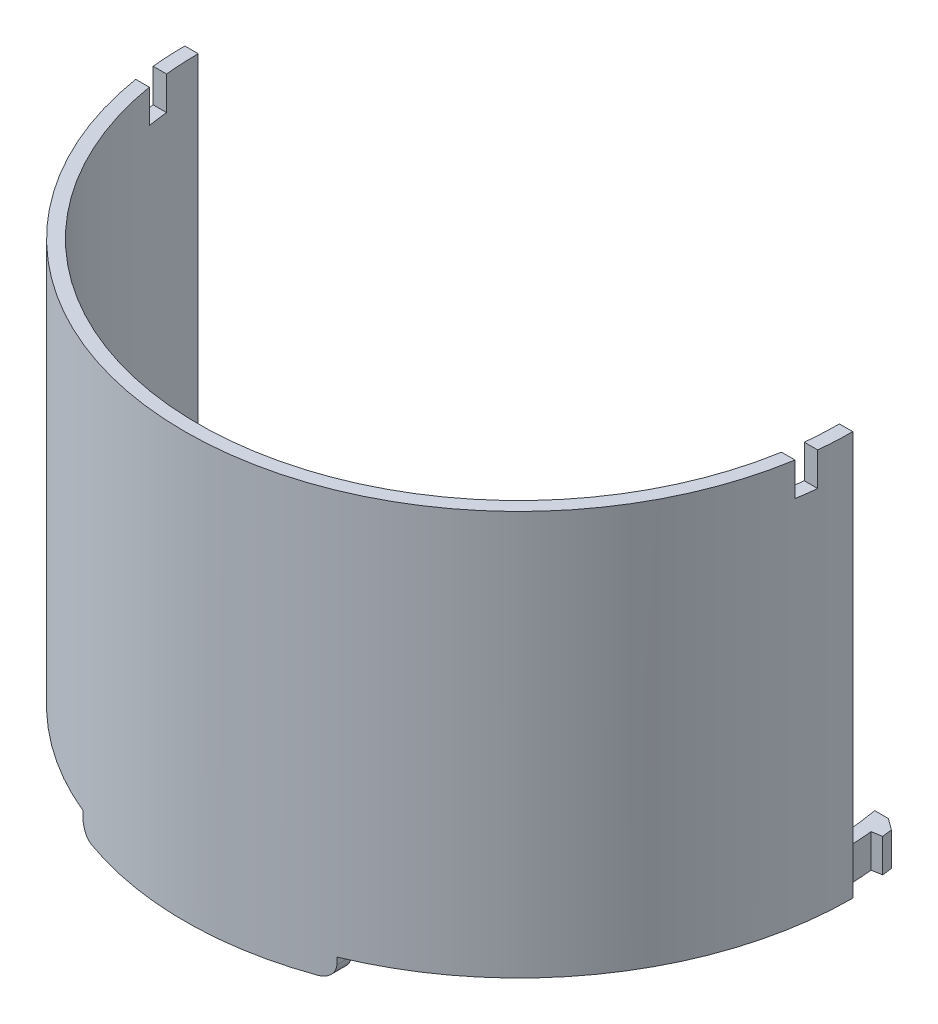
ISO-10303-21;
HEADER;
FILE_DESCRIPTION(('STEP AP214'),'2;1');
FILE_NAME('part.step','',(''),(''),'','','');
FILE_SCHEMA(('AUTOMOTIVE_DESIGN { 1 0 10303 214 1 1 1 1 }'));
ENDSEC;
DATA;
#1=APPLICATION_CONTEXT('core data for automotive mechanical design processes');
#2=APPLICATION_PROTOCOL_DEFINITION('international standard','automotive_design',2000,#1);
#3=PRODUCT_CONTEXT('',#1,'mechanical');
#4=PRODUCT('Part','Part','',(#3));
#5=PRODUCT_RELATED_PRODUCT_CATEGORY('part','',(#4));
#6=PRODUCT_DEFINITION_FORMATION('','',#4);
#7=PRODUCT_DEFINITION_CONTEXT('part definition',#1,'design');
#8=PRODUCT_DEFINITION('design','',#6,#7);
#9=PRODUCT_DEFINITION_SHAPE('','',#8);
#10=(LENGTH_UNIT() NAMED_UNIT(*) SI_UNIT(.MILLI.,.METRE.));
#11=(NAMED_UNIT(*) PLANE_ANGLE_UNIT() SI_UNIT($,.RADIAN.));
#12=(NAMED_UNIT(*) SI_UNIT($,.STERADIAN.) SOLID_ANGLE_UNIT());
#13=UNCERTAINTY_MEASURE_WITH_UNIT(LENGTH_MEASURE(1.E-05),#10,'distance_accuracy_value','');
#14=(GEOMETRIC_REPRESENTATION_CONTEXT(3) GLOBAL_UNCERTAINTY_ASSIGNED_CONTEXT((#13)) GLOBAL_UNIT_ASSIGNED_CONTEXT((#10,
#11,#12)) REPRESENTATION_CONTEXT('',''));
#15=CARTESIAN_POINT('',(0.,0.,0.));
#16=DIRECTION('',(0.,0.,1.));
#17=DIRECTION('',(1.,0.,0.));
#18=AXIS2_PLACEMENT_3D('',#15,#16,#17);
#19=CARTESIAN_POINT('',(0.,0.,0.));
#20=DIRECTION('',(0.,1.,0.));
#21=DIRECTION('',(0.,0.,1.));
#22=AXIS2_PLACEMENT_3D('',#19,#20,#21);
#23=PLANE('',#22);
#24=DIRECTION('',(0.,0.,-1.));
#25=VECTOR('',#24,1.);
#26=CARTESIAN_POINT('',(-19.,0.,44.0794736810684));
#27=LINE('',#26,#25);
#28=CARTESIAN_POINT('',(-19.,0.,46.2493243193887));
#29=VERTEX_POINT('',#28);
#30=CARTESIAN_POINT('',(-19.,0.,44.0794736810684));
#31=VERTEX_POINT('',#30);
#32=EDGE_CURVE('E275',#29,#31,#27,.T.);
#33=ORIENTED_EDGE('',*,*,#32,.F.);
#34=CARTESIAN_POINT('',(0.,0.,0.));
#35=DIRECTION('',(0.,1.,0.));
#36=DIRECTION('',(0.,0.,1.));
#37=AXIS2_PLACEMENT_3D('',#34,#35,#36);
#38=CIRCLE('',#37,50.);
#39=CARTESIAN_POINT('',(-50.,0.,0.));
#40=VERTEX_POINT('',#39);
#41=EDGE_CURVE('E269',#40,#29,#38,.T.);
#42=ORIENTED_EDGE('',*,*,#41,.F.);
#43=DIRECTION('',(-1.,0.,0.));
#44=VECTOR('',#43,1.);
#45=CARTESIAN_POINT('',(-50.,0.,0.));
#46=LINE('',#45,#44);
#47=CARTESIAN_POINT('',(-48.,0.,0.));
#48=VERTEX_POINT('',#47);
#49=EDGE_CURVE('E545',#48,#40,#46,.T.);
#50=ORIENTED_EDGE('',*,*,#49,.F.);
#51=CARTESIAN_POINT('',(0.,0.,0.));
#52=DIRECTION('',(0.,-1.,0.));
#53=DIRECTION('',(0.,0.,-1.));
#54=AXIS2_PLACEMENT_3D('',#51,#52,#53);
#55=CIRCLE('',#54,48.);
#56=CARTESIAN_POINT('',(-47.7388730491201,0.,-5.00000000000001));
#57=VERTEX_POINT('',#56);
#58=EDGE_CURVE('E356',#48,#57,#55,.T.);
#59=ORIENTED_EDGE('',*,*,#58,.T.);
#60=DIRECTION('',(-0.984809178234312,0.,-0.173640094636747));
#61=VECTOR('',#60,1.);
#62=CARTESIAN_POINT('',(-49.2196201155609,0.,-5.26108312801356));
#63=LINE('',#62,#61);
#64=CARTESIAN_POINT('',(-49.2196201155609,0.,-5.26108312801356));
#65=VERTEX_POINT('',#64);
#66=EDGE_CURVE('E934',#57,#65,#63,.T.);
#67=ORIENTED_EDGE('',*,*,#66,.T.);
#68=DIRECTION('',(0.121338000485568,0.,-0.992611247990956));
#69=VECTOR('',#68,1.);
#70=CARTESIAN_POINT('',(-49.0376131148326,0.,-6.75));
#71=LINE('',#70,#69);
#72=CARTESIAN_POINT('',(-49.0376131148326,0.,-6.75));
#73=VERTEX_POINT('',#72);
#74=EDGE_CURVE('E936',#65,#73,#71,.T.);
#75=ORIENTED_EDGE('',*,*,#74,.T.);
#76=DIRECTION('',(0.807135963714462,0.,-0.590365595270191));
#77=VECTOR('',#76,1.);
#78=CARTESIAN_POINT('',(-47.328638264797,0.,-8.));
#79=LINE('',#78,#77);
#80=CARTESIAN_POINT('',(-47.328638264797,0.,-8.));
#81=VERTEX_POINT('',#80);
#82=EDGE_CURVE('E398',#73,#81,#79,.T.);
#83=ORIENTED_EDGE('',*,*,#82,.T.);
#84=DIRECTION('',(1.,0.,0.));
#85=VECTOR('',#84,1.);
#86=CARTESIAN_POINT('',(-45.2990066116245,0.,-8.));
#87=LINE('',#86,#85);
#88=CARTESIAN_POINT('',(-45.2990066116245,0.,-8.));
#89=VERTEX_POINT('',#88);
#90=EDGE_CURVE('E396',#81,#89,#87,.T.);
#91=ORIENTED_EDGE('',*,*,#90,.T.);
#92=CARTESIAN_POINT('',(0.,0.,0.));
#93=DIRECTION('',(0.,1.,0.));
#94=DIRECTION('',(0.,0.,-1.));
#95=AXIS2_PLACEMENT_3D('',#92,#93,#94);
#96=CIRCLE('',#95,46.);
#97=CARTESIAN_POINT('',(-45.91006834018,0.,2.875));
#98=VERTEX_POINT('',#97);
#99=EDGE_CURVE('E380',#89,#98,#96,.T.);
#100=ORIENTED_EDGE('',*,*,#99,.T.);
#101=CARTESIAN_POINT('',(-45.7417046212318,0.,4.86790081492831));
#102=DIRECTION('',(0.,1.,0.));
#103=DIRECTION('',(0.,0.,1.));
#104=AXIS2_PLACEMENT_3D('',#101,#102,#103);
#105=CIRCLE('',#104,2.);
#106=CARTESIAN_POINT('',(-47.7304743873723,0.,5.07954867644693));
#107=VERTEX_POINT('',#106);
#108=EDGE_CURVE('E40',#98,#107,#105,.T.);
#109=ORIENTED_EDGE('',*,*,#108,.T.);
#110=CARTESIAN_POINT('',(0.,0.,0.));
#111=DIRECTION('',(0.,-1.,0.));
#112=DIRECTION('',(0.,0.,1.));
#113=AXIS2_PLACEMENT_3D('',#110,#111,#112);
#114=CIRCLE('',#113,48.);
#115=EDGE_CURVE('E283',#31,#107,#114,.T.);
#116=ORIENTED_EDGE('',*,*,#115,.F.);
#117=EDGE_LOOP('',(#33,#42,#50,#59,#67,#75,#83,#91,#100,#109,#116));
#118=FACE_BOUND('',#117,.T.);
#119=ADVANCED_FACE('F32',(#118),#23,.F.);
#120=DIRECTION('',(0.,0.,1.));
#121=VECTOR('',#120,1.);
#122=CARTESIAN_POINT('',(19.,0.,44.0794736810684));
#123=LINE('',#122,#121);
#124=CARTESIAN_POINT('',(19.,0.,44.0794736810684));
#125=VERTEX_POINT('',#124);
#126=CARTESIAN_POINT('',(19.,0.,46.2493243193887));
#127=VERTEX_POINT('',#126);
#128=EDGE_CURVE('E265',#125,#127,#123,.T.);
#129=ORIENTED_EDGE('',*,*,#128,.F.);
#130=CARTESIAN_POINT('',(47.7304743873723,0.,5.07954867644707));
#131=VERTEX_POINT('',#130);
#132=EDGE_CURVE('E306',#131,#125,#114,.T.);
#133=ORIENTED_EDGE('',*,*,#132,.F.);
#134=CARTESIAN_POINT('',(45.7417046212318,0.,4.86790081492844));
#135=DIRECTION('',(0.,1.,0.));
#136=DIRECTION('',(0.,0.,1.));
#137=AXIS2_PLACEMENT_3D('',#134,#135,#136);
#138=CIRCLE('',#137,2.);
#139=CARTESIAN_POINT('',(45.91006834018,0.,2.875));
#140=VERTEX_POINT('',#139);
#141=EDGE_CURVE('E365',#131,#140,#138,.T.);
#142=ORIENTED_EDGE('',*,*,#141,.T.);
#143=CARTESIAN_POINT('',(0.,0.,0.));
#144=DIRECTION('',(0.,1.,0.));
#145=DIRECTION('',(0.,0.,1.));
#146=AXIS2_PLACEMENT_3D('',#143,#144,#145);
#147=CIRCLE('',#146,46.);
#148=CARTESIAN_POINT('',(45.2990066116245,0.,-8.));
#149=VERTEX_POINT('',#148);
#150=EDGE_CURVE('E437',#140,#149,#147,.T.);
#151=ORIENTED_EDGE('',*,*,#150,.T.);
#152=DIRECTION('',(1.,0.,0.));
#153=VECTOR('',#152,1.);
#154=CARTESIAN_POINT('',(45.2990066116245,0.,-8.));
#155=LINE('',#154,#153);
#156=CARTESIAN_POINT('',(47.328638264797,0.,-8.));
#157=VERTEX_POINT('',#156);
#158=EDGE_CURVE('E440',#149,#157,#155,.T.);
#159=ORIENTED_EDGE('',*,*,#158,.T.);
#160=DIRECTION('',(0.807135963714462,0.,0.590365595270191));
#161=VECTOR('',#160,1.);
#162=CARTESIAN_POINT('',(47.328638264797,0.,-8.));
#163=LINE('',#162,#161);
#164=CARTESIAN_POINT('',(49.0376131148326,0.,-6.75));
#165=VERTEX_POINT('',#164);
#166=EDGE_CURVE('E443',#157,#165,#163,.T.);
#167=ORIENTED_EDGE('',*,*,#166,.T.);
#168=DIRECTION('',(0.121338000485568,0.,0.992611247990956));
#169=VECTOR('',#168,1.);
#170=CARTESIAN_POINT('',(49.0376131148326,0.,-6.75));
#171=LINE('',#170,#169);
#172=CARTESIAN_POINT('',(49.2196201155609,0.,-5.26108312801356));
#173=VERTEX_POINT('',#172);
#174=EDGE_CURVE('E446',#165,#173,#171,.T.);
#175=ORIENTED_EDGE('',*,*,#174,.T.);
#176=DIRECTION('',(-0.984809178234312,0.,0.173640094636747));
#177=VECTOR('',#176,1.);
#178=CARTESIAN_POINT('',(49.2196201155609,0.,-5.26108312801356));
#179=LINE('',#178,#177);
#180=CARTESIAN_POINT('',(47.7388730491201,0.,-5.));
#181=VERTEX_POINT('',#180);
#182=EDGE_CURVE('E449',#173,#181,#179,.T.);
#183=ORIENTED_EDGE('',*,*,#182,.T.);
#184=CARTESIAN_POINT('',(0.,0.,0.));
#185=DIRECTION('',(0.,-1.,0.));
#186=DIRECTION('',(0.,0.,1.));
#187=AXIS2_PLACEMENT_3D('',#184,#185,#186);
#188=CIRCLE('',#187,48.);
#189=CARTESIAN_POINT('',(48.,0.,0.));
#190=VERTEX_POINT('',#189);
#191=EDGE_CURVE('E417',#181,#190,#188,.T.);
#192=ORIENTED_EDGE('',*,*,#191,.T.);
#193=DIRECTION('',(-1.,0.,0.));
#194=VECTOR('',#193,1.);
#195=CARTESIAN_POINT('',(48.,0.,0.));
#196=LINE('',#195,#194);
#197=CARTESIAN_POINT('',(50.,0.,0.));
#198=VERTEX_POINT('',#197);
#199=EDGE_CURVE('E267',#198,#190,#196,.T.);
#200=ORIENTED_EDGE('',*,*,#199,.F.);
#201=EDGE_CURVE('E252',#127,#198,#38,.T.);
#202=ORIENTED_EDGE('',*,*,#201,.F.);
#203=EDGE_LOOP('',(#129,#133,#142,#151,#159,#167,#175,#183,#192,#200,#202));
#204=FACE_BOUND('',#203,.T.);
#205=ADVANCED_FACE('F263',(#204),#23,.F.);
#206=CARTESIAN_POINT('',(0.,60.5,0.));
#207=DIRECTION('',(0.,1.,0.));
#208=DIRECTION('',(0.,0.,1.));
#209=AXIS2_PLACEMENT_3D('',#206,#207,#208);
#210=PLANE('',#209);
#211=DIRECTION('',(-1.,0.,0.));
#212=VECTOR('',#211,1.);
#213=CARTESIAN_POINT('',(49.749371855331,60.5,5.00000000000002));
#214=LINE('',#213,#212);
#215=CARTESIAN_POINT('',(49.749371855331,60.5,5.00000000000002));
#216=VERTEX_POINT('',#215);
#217=CARTESIAN_POINT('',(47.7388730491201,60.5,5.00000000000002));
#218=VERTEX_POINT('',#217);
#219=EDGE_CURVE('E466',#216,#218,#214,.T.);
#220=ORIENTED_EDGE('',*,*,#219,.F.);
#221=CARTESIAN_POINT('',(0.,60.5,0.));
#222=DIRECTION('',(0.,1.,0.));
#223=DIRECTION('',(0.,0.,1.));
#224=AXIS2_PLACEMENT_3D('',#221,#222,#223);
#225=CIRCLE('',#224,50.);
#226=CARTESIAN_POINT('',(50.,60.5,0.));
#227=VERTEX_POINT('',#226);
#228=EDGE_CURVE('E510',#216,#227,#225,.T.);
#229=ORIENTED_EDGE('',*,*,#228,.T.);
#230=DIRECTION('',(-1.,0.,0.));
#231=VECTOR('',#230,1.);
#232=CARTESIAN_POINT('',(48.,60.5,0.));
#233=LINE('',#232,#231);
#234=CARTESIAN_POINT('',(48.,60.5,0.));
#235=VERTEX_POINT('',#234);
#236=EDGE_CURVE('E508',#227,#235,#233,.T.);
#237=ORIENTED_EDGE('',*,*,#236,.T.);
#238=CARTESIAN_POINT('',(0.,60.5,0.));
#239=DIRECTION('',(0.,-1.,0.));
#240=DIRECTION('',(0.,0.,1.));
#241=AXIS2_PLACEMENT_3D('',#238,#239,#240);
#242=CIRCLE('',#241,48.);
#243=EDGE_CURVE('E513',#235,#218,#242,.T.);
#244=ORIENTED_EDGE('',*,*,#243,.T.);
#245=EDGE_LOOP('',(#220,#229,#237,#244));
#246=FACE_BOUND('',#245,.T.);
#247=ADVANCED_FACE('F606',(#246),#210,.T.);
#248=DIRECTION('',(-1.,0.,0.));
#249=VECTOR('',#248,1.);
#250=CARTESIAN_POINT('',(0.,60.5,5.00000000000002));
#251=LINE('',#250,#249);
#252=CARTESIAN_POINT('',(-47.7388730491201,60.5,5.));
#253=VERTEX_POINT('',#252);
#254=CARTESIAN_POINT('',(-49.749371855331,60.5,5.));
#255=VERTEX_POINT('',#254);
#256=EDGE_CURVE('E531',#253,#255,#251,.T.);
#257=ORIENTED_EDGE('',*,*,#256,.F.);
#258=CARTESIAN_POINT('',(-48.,60.5,0.));
#259=VERTEX_POINT('',#258);
#260=EDGE_CURVE('E512',#253,#259,#242,.T.);
#261=ORIENTED_EDGE('',*,*,#260,.T.);
#262=DIRECTION('',(-1.,0.,0.));
#263=VECTOR('',#262,1.);
#264=CARTESIAN_POINT('',(-50.,60.5,0.));
#265=LINE('',#264,#263);
#266=CARTESIAN_POINT('',(-50.,60.5,0.));
#267=VERTEX_POINT('',#266);
#268=EDGE_CURVE('E516',#259,#267,#265,.T.);
#269=ORIENTED_EDGE('',*,*,#268,.T.);
#270=EDGE_CURVE('E505',#267,#255,#225,.T.);
#271=ORIENTED_EDGE('',*,*,#270,.T.);
#272=EDGE_LOOP('',(#257,#261,#269,#271));
#273=FACE_BOUND('',#272,.T.);
#274=ADVANCED_FACE('F342',(#273),#210,.T.);
#275=CARTESIAN_POINT('',(0.,60.5,0.));
#276=DIRECTION('',(0.,-1.,0.));
#277=DIRECTION('',(0.,0.,-1.));
#278=AXIS2_PLACEMENT_3D('',#275,#276,#277);
#279=CYLINDRICAL_SURFACE('',#278,50.);
#280=CARTESIAN_POINT('',(0.,-3.,0.));
#281=DIRECTION('',(0.,-1.,0.));
#282=DIRECTION('',(0.,0.,-1.));
#283=AXIS2_PLACEMENT_3D('',#280,#281,#282);
#284=CIRCLE('',#283,50.);
#285=CARTESIAN_POINT('',(17.,-3.,47.021271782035));
#286=VERTEX_POINT('',#285);
#287=CARTESIAN_POINT('',(-17.,-3.,47.021271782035));
#288=VERTEX_POINT('',#287);
#289=EDGE_CURVE('E290',#286,#288,#284,.T.);
#290=ORIENTED_EDGE('',*,*,#289,.F.);
#291=CARTESIAN_POINT('',(17.,-3.,47.021271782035));
#292=CARTESIAN_POINT('',(17.0595298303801,-2.99999748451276,46.9997501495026));
#293=CARTESIAN_POINT('',(17.1189889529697,-2.99734080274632,46.9781247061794));
#294=CARTESIAN_POINT('',(17.2374096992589,-2.98675005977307,46.9348023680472));
#295=CARTESIAN_POINT('',(17.2963713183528,-2.97881594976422,46.9131054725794));
#296=CARTESIAN_POINT('',(17.4719720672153,-2.94714435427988,46.8481132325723));
#297=CARTESIAN_POINT('',(17.5873292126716,-2.91553760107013,46.8049155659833));
#298=CARTESIAN_POINT('',(17.8111631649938,-2.83202415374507,46.7201973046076));
#299=CARTESIAN_POINT('',(17.9196345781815,-2.7801017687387,46.6786780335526));
#300=CARTESIAN_POINT('',(18.126346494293,-2.65704260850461,46.5987964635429));
#301=CARTESIAN_POINT('',(18.2245923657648,-2.58591598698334,46.5604325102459));
#302=CARTESIAN_POINT('',(18.4052548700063,-2.4280370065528,46.4893084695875));
#303=CARTESIAN_POINT('',(18.4880076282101,-2.34172291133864,46.4564316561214));
#304=CARTESIAN_POINT('',(18.6375935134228,-2.15439757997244,46.3966228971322));
#305=CARTESIAN_POINT('',(18.7044281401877,-2.05338772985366,46.3696903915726));
#306=CARTESIAN_POINT('',(18.8154454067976,-1.84675781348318,46.3247490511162));
#307=CARTESIAN_POINT('',(18.8608382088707,-1.74189018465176,46.3062661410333));
#308=CARTESIAN_POINT('',(18.9332081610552,-1.52507955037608,46.276723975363));
#309=CARTESIAN_POINT('',(18.9602175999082,-1.41314932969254,46.2656517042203));
#310=CARTESIAN_POINT('',(18.9849403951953,-1.25007932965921,46.2555087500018));
#311=CARTESIAN_POINT('',(18.9905857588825,-1.20022372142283,46.2531909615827));
#312=CARTESIAN_POINT('',(18.9981123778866,-1.10025455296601,46.2500998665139));
#313=CARTESIAN_POINT('',(18.9999990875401,-1.0501414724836,46.249324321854));
#314=CARTESIAN_POINT('',(19.,-1.,46.2493243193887));
#315=B_SPLINE_CURVE_WITH_KNOTS('',3,(#291,#292,#293,#294,#295,#296,#297,#298,#299,#300,#301,
#302,#303,#304,#305,#306,#307,#308,#309,#310,#311,#312,#313,#314),.UNSPECIFIED.,.F.,.F.,(4,2,2,
2,2,2,2,2,2,2,2,4),(0.,0.189784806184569,0.379571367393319,0.75913779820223,1.13899796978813,
1.51865769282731,1.8887632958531,2.25883401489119,2.60431211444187,2.9491818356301,
3.09972733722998,3.25005421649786),.UNSPECIFIED.);
#316=CARTESIAN_POINT('',(19.,-1.,46.2493243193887));
#317=VERTEX_POINT('',#316);
#318=EDGE_CURVE('E254',#286,#317,#315,.T.);
#319=ORIENTED_EDGE('',*,*,#318,.T.);
#320=DIRECTION('',(0.,1.,0.));
#321=VECTOR('',#320,1.);
#322=CARTESIAN_POINT('',(19.,-3.,46.2493243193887));
#323=LINE('',#322,#321);
#324=EDGE_CURVE('E247',#317,#127,#323,.T.);
#325=ORIENTED_EDGE('',*,*,#324,.T.);
#326=ORIENTED_EDGE('',*,*,#201,.T.);
#327=DIRECTION('',(0.,-1.,0.));
#328=VECTOR('',#327,1.);
#329=CARTESIAN_POINT('',(50.,60.5,0.));
#330=LINE('',#329,#328);
#331=EDGE_CURVE('E536',#227,#198,#330,.T.);
#332=ORIENTED_EDGE('',*,*,#331,.F.);
#333=ORIENTED_EDGE('',*,*,#228,.F.);
#334=DIRECTION('',(0.,1.,0.));
#335=VECTOR('',#334,1.);
#336=CARTESIAN_POINT('',(49.749371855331,55.5,5.00000000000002));
#337=LINE('',#336,#335);
#338=CARTESIAN_POINT('',(49.749371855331,55.5,5.00000000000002));
#339=VERTEX_POINT('',#338);
#340=EDGE_CURVE('E477',#339,#216,#337,.T.);
#341=ORIENTED_EDGE('',*,*,#340,.F.);
#342=CARTESIAN_POINT('',(0.,55.5,0.));
#343=DIRECTION('',(0.,1.,0.));
#344=DIRECTION('',(0.,0.,1.));
#345=AXIS2_PLACEMENT_3D('',#342,#343,#344);
#346=CIRCLE('',#345,50.);
#347=CARTESIAN_POINT('',(49.3558507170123,55.5,8.00000000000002));
#348=VERTEX_POINT('',#347);
#349=EDGE_CURVE('E486',#348,#339,#346,.T.);
#350=ORIENTED_EDGE('',*,*,#349,.F.);
#351=DIRECTION('',(0.,-1.,0.));
#352=VECTOR('',#351,1.);
#353=CARTESIAN_POINT('',(49.3558507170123,60.5,8.00000000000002));
#354=LINE('',#353,#352);
#355=CARTESIAN_POINT('',(49.3558507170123,60.5,8.00000000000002));
#356=VERTEX_POINT('',#355);
#357=EDGE_CURVE('E479',#348,#356,#354,.F.);
#358=ORIENTED_EDGE('',*,*,#357,.T.);
#359=CARTESIAN_POINT('',(-49.3558507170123,60.5,8.));
#360=VERTEX_POINT('',#359);
#361=EDGE_CURVE('E509',#360,#356,#225,.T.);
#362=ORIENTED_EDGE('',*,*,#361,.F.);
#363=DIRECTION('',(0.,-1.,0.));
#364=VECTOR('',#363,1.);
#365=CARTESIAN_POINT('',(-49.3558507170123,60.5,8.));
#366=LINE('',#365,#364);
#367=CARTESIAN_POINT('',(-49.3558507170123,55.5,8.));
#368=VERTEX_POINT('',#367);
#369=EDGE_CURVE('E496',#360,#368,#366,.T.);
#370=ORIENTED_EDGE('',*,*,#369,.T.);
#371=CARTESIAN_POINT('',(0.,55.5,0.));
#372=DIRECTION('',(0.,1.,0.));
#373=DIRECTION('',(0.,0.,1.));
#374=AXIS2_PLACEMENT_3D('',#371,#372,#373);
#375=CIRCLE('',#374,50.);
#376=CARTESIAN_POINT('',(-49.749371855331,55.5,5.));
#377=VERTEX_POINT('',#376);
#378=EDGE_CURVE('E270',#377,#368,#375,.T.);
#379=ORIENTED_EDGE('',*,*,#378,.F.);
#380=DIRECTION('',(0.,1.,0.));
#381=VECTOR('',#380,1.);
#382=CARTESIAN_POINT('',(-49.749371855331,55.5,5.));
#383=LINE('',#382,#381);
#384=EDGE_CURVE('E493',#377,#255,#383,.T.);
#385=ORIENTED_EDGE('',*,*,#384,.T.);
#386=ORIENTED_EDGE('',*,*,#270,.F.);
#387=DIRECTION('',(0.,-1.,0.));
#388=VECTOR('',#387,1.);
#389=CARTESIAN_POINT('',(-50.,60.5,0.));
#390=LINE('',#389,#388);
#391=EDGE_CURVE('E519',#267,#40,#390,.T.);
#392=ORIENTED_EDGE('',*,*,#391,.T.);
#393=ORIENTED_EDGE('',*,*,#41,.T.);
#394=DIRECTION('',(0.,1.,0.));
#395=VECTOR('',#394,1.);
#396=CARTESIAN_POINT('',(-19.,-3.,46.2493243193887));
#397=LINE('',#396,#395);
#398=CARTESIAN_POINT('',(-19.,-1.,46.2493243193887));
#399=VERTEX_POINT('',#398);
#400=EDGE_CURVE('E259',#399,#29,#397,.T.);
#401=ORIENTED_EDGE('',*,*,#400,.F.);
#402=CARTESIAN_POINT('',(-19.,-1.,46.2493243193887));
#403=CARTESIAN_POINT('',(-19.0000074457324,-1.05331050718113,46.2493205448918));
#404=CARTESIAN_POINT('',(-18.9978686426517,-1.10661695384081,46.2501998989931));
#405=CARTESIAN_POINT('',(-18.9893558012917,-1.21282198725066,46.2536961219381));
#406=CARTESIAN_POINT('',(-18.9829826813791,-1.26572065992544,46.2563126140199));
#407=CARTESIAN_POINT('',(-18.9660828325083,-1.37058240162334,46.2632443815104));
#408=CARTESIAN_POINT('',(-18.9555681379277,-1.42254772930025,46.2675547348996));
#409=CARTESIAN_POINT('',(-18.9305035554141,-1.52531660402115,46.2778156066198));
#410=CARTESIAN_POINT('',(-18.9159535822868,-1.57612012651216,46.2837661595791));
#411=CARTESIAN_POINT('',(-18.8664583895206,-1.72622457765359,46.3039742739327));
#412=CARTESIAN_POINT('',(-18.8256464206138,-1.82335065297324,46.3205971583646));
#413=CARTESIAN_POINT('',(-18.7299166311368,-2.00912619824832,46.3593881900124));
#414=CARTESIAN_POINT('',(-18.6749924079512,-2.09777179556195,46.3815588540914));
#415=CARTESIAN_POINT('',(-18.5508123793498,-2.26743319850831,46.4313683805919));
#416=CARTESIAN_POINT('',(-18.4811431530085,-2.34810031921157,46.4591636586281));
#417=CARTESIAN_POINT('',(-18.3308027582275,-2.496712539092,46.5186865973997));
#418=CARTESIAN_POINT('',(-18.2501283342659,-2.56465385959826,46.5504154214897));
#419=CARTESIAN_POINT('',(-18.0739566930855,-2.69090793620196,46.6191122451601));
#420=CARTESIAN_POINT('',(-17.9778160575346,-2.74820761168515,46.6562917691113));
#421=CARTESIAN_POINT('',(-17.7780378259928,-2.84581202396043,46.7327810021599));
#422=CARTESIAN_POINT('',(-17.6743987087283,-2.8861133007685,46.7720911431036));
#423=CARTESIAN_POINT('',(-17.4760875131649,-2.94489034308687,46.8465157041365));
#424=CARTESIAN_POINT('',(-17.3820020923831,-2.96552288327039,46.8815109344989));
#425=CARTESIAN_POINT('',(-17.1919876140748,-2.99307987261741,46.9515282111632));
#426=CARTESIAN_POINT('',(-17.096060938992,-3.00002096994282,46.9865501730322));
#427=CARTESIAN_POINT('',(-17.,-3.,47.021271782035));
#428=B_SPLINE_CURVE_WITH_KNOTS('',3,(#402,#403,#404,#405,#406,#407,#408,#409,#410,#411,#412,
#413,#414,#415,#416,#417,#418,#419,#420,#421,#422,#423,#424,#425,#426,#427),.UNSPECIFIED.,.F.,
.F.,(4,2,2,2,2,2,2,2,2,2,2,2,4),(0.,0.159874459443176,0.319714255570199,0.47909298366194,
0.638475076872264,0.956844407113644,1.27535843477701,1.60439208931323,1.93352328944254,
2.28579962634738,2.6381476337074,2.94467332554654,3.25082606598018),.UNSPECIFIED.);
#429=EDGE_CURVE('E347',#399,#288,#428,.T.);
#430=ORIENTED_EDGE('',*,*,#429,.T.);
#431=EDGE_LOOP('',(#290,#319,#325,#326,#332,#333,#341,#350,#358,#362,#370,#379,#385,#386,#392,
#393,#401,#430));
#432=FACE_BOUND('',#431,.T.);
#433=ADVANCED_FACE('F250',(#432),#279,.T.);
#434=CARTESIAN_POINT('',(48.,60.5,0.));
#435=DIRECTION('',(0.,0.,1.));
#436=DIRECTION('',(1.,0.,0.));
#437=AXIS2_PLACEMENT_3D('',#434,#435,#436);
#438=PLANE('',#437);
#439=ORIENTED_EDGE('',*,*,#199,.T.);
#440=DIRECTION('',(0.,-1.,0.));
#441=VECTOR('',#440,1.);
#442=CARTESIAN_POINT('',(48.,5.,0.));
#443=LINE('',#442,#441);
#444=CARTESIAN_POINT('',(48.,5.,0.));
#445=VERTEX_POINT('',#444);
#446=EDGE_CURVE('E454',#190,#445,#443,.F.);
#447=ORIENTED_EDGE('',*,*,#446,.T.);
#448=DIRECTION('',(0.,-1.,0.));
#449=VECTOR('',#448,1.);
#450=CARTESIAN_POINT('',(48.,60.5,0.));
#451=LINE('',#450,#449);
#452=EDGE_CURVE('E538',#235,#445,#451,.T.);
#453=ORIENTED_EDGE('',*,*,#452,.F.);
#454=ORIENTED_EDGE('',*,*,#236,.F.);
#455=ORIENTED_EDGE('',*,*,#331,.T.);
#456=EDGE_LOOP('',(#439,#447,#453,#454,#455));
#457=FACE_BOUND('',#456,.T.);
#458=ADVANCED_FACE('F334',(#457),#438,.F.);
#459=CARTESIAN_POINT('',(0.,60.5,0.));
#460=DIRECTION('',(0.,-1.,0.));
#461=DIRECTION('',(0.,0.,-1.));
#462=AXIS2_PLACEMENT_3D('',#459,#460,#461);
#463=CYLINDRICAL_SURFACE('',#462,48.);
#464=DIRECTION('',(0.,1.,0.));
#465=VECTOR('',#464,1.);
#466=CARTESIAN_POINT('',(19.,-3.,44.0794736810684));
#467=LINE('',#466,#465);
#468=CARTESIAN_POINT('',(19.,-1.,44.0794736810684));
#469=VERTEX_POINT('',#468);
#470=EDGE_CURVE('E258',#469,#125,#467,.T.);
#471=ORIENTED_EDGE('',*,*,#470,.F.);
#472=CARTESIAN_POINT('',(19.,-1.,44.0794736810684));
#473=CARTESIAN_POINT('',(19.0000076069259,-1.05305225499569,44.0794696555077));
#474=CARTESIAN_POINT('',(18.9978892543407,-1.10610031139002,44.0803834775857));
#475=CARTESIAN_POINT('',(18.9894591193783,-1.21178795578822,44.0840161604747));
#476=CARTESIAN_POINT('',(18.9831483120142,-1.26442763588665,44.0867346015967));
#477=CARTESIAN_POINT('',(18.9664173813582,-1.36876337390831,44.0939348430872));
#478=CARTESIAN_POINT('',(18.9560099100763,-1.42046182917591,44.0984112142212));
#479=CARTESIAN_POINT('',(18.9312057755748,-1.5226999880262,44.1090651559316));
#480=CARTESIAN_POINT('',(18.9168090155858,-1.57323966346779,44.1152427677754));
#481=CARTESIAN_POINT('',(18.8678482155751,-1.72255324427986,44.1362161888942));
#482=CARTESIAN_POINT('',(18.8274910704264,-1.81916032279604,44.1534623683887));
#483=CARTESIAN_POINT('',(18.7328766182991,-2.00396390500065,44.1936868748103));
#484=CARTESIAN_POINT('',(18.6786122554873,-2.09215610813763,44.2166681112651));
#485=CARTESIAN_POINT('',(18.5558185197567,-2.26123941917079,44.2683428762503));
#486=CARTESIAN_POINT('',(18.4868486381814,-2.34175694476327,44.2972112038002));
#487=CARTESIAN_POINT('',(18.3380515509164,-2.49019272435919,44.3590165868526));
#488=CARTESIAN_POINT('',(18.2582211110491,-2.55810721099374,44.391954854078));
#489=CARTESIAN_POINT('',(18.0833792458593,-2.68488073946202,44.4634790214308));
#490=CARTESIAN_POINT('',(17.9876732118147,-2.74264661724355,44.5023042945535));
#491=CARTESIAN_POINT('',(17.7887538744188,-2.84124886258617,44.5821907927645));
#492=CARTESIAN_POINT('',(17.6855385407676,-2.88208063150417,44.6232526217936));
#493=CARTESIAN_POINT('',(17.4858517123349,-2.94257530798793,44.7018472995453));
#494=CARTESIAN_POINT('',(17.3898873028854,-2.964072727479,44.7392714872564));
#495=CARTESIAN_POINT('',(17.1959963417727,-2.9927871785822,44.8141575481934));
#496=CARTESIAN_POINT('',(17.0980723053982,-3.00002146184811,44.8516193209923));
#497=CARTESIAN_POINT('',(17.,-3.,44.8887513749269));
#498=B_SPLINE_CURVE_WITH_KNOTS('',3,(#472,#473,#474,#475,#476,#477,#478,#479,#480,#481,#482,
#483,#484,#485,#486,#487,#488,#489,#490,#491,#492,#493,#494,#495,#496,#497),.UNSPECIFIED.,.F.,
.F.,(4,2,2,2,2,2,2,2,2,2,2,2,4),(0.,0.159099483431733,0.318161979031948,0.476737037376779,
0.635315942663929,0.952056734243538,1.26895854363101,1.59718616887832,1.92551175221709,
2.27900435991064,2.63259289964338,2.94728665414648,3.26159954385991),.UNSPECIFIED.);
#499=CARTESIAN_POINT('',(17.,-3.,44.8887513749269));
#500=VERTEX_POINT('',#499);
#501=EDGE_CURVE('E320',#469,#500,#498,.T.);
#502=ORIENTED_EDGE('',*,*,#501,.T.);
#503=CARTESIAN_POINT('',(0.,-3.,0.));
#504=DIRECTION('',(0.,1.,0.));
#505=DIRECTION('',(0.,0.,-1.));
#506=AXIS2_PLACEMENT_3D('',#503,#504,#505);
#507=CIRCLE('',#506,48.);
#508=CARTESIAN_POINT('',(-17.,-3.,44.8887513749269));
#509=VERTEX_POINT('',#508);
#510=EDGE_CURVE('E278',#509,#500,#507,.T.);
#511=ORIENTED_EDGE('',*,*,#510,.F.);
#512=CARTESIAN_POINT('',(-17.,-3.,44.8887513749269));
#513=CARTESIAN_POINT('',(-17.0598505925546,-2.99999725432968,44.8660858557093));
#514=CARTESIAN_POINT('',(-17.1196257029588,-2.99731210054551,44.8433104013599));
#515=CARTESIAN_POINT('',(-17.2386679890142,-2.98660878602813,44.7976827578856));
#516=CARTESIAN_POINT('',(-17.2979351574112,-2.97859054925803,44.7748305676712));
#517=CARTESIAN_POINT('',(-17.4744539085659,-2.94658092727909,44.7063679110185));
#518=CARTESIAN_POINT('',(-17.5904050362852,-2.91463464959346,44.6608580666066));
#519=CARTESIAN_POINT('',(-17.8153635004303,-2.83020377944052,44.5715998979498));
#520=CARTESIAN_POINT('',(-17.9243652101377,-2.77770278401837,44.5278530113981));
#521=CARTESIAN_POINT('',(-18.1320311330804,-2.65322043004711,44.4436945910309));
#522=CARTESIAN_POINT('',(-18.2307010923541,-2.58124998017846,44.4032812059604));
#523=CARTESIAN_POINT('',(-18.4117857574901,-2.42162773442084,44.3284953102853));
#524=CARTESIAN_POINT('',(-18.4945760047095,-2.33446732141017,44.2939861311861));
#525=CARTESIAN_POINT('',(-18.6440574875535,-2.14524633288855,44.2312752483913));
#526=CARTESIAN_POINT('',(-18.7107509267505,-2.04318779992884,44.203072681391));
#527=CARTESIAN_POINT('',(-18.8208500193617,-1.83507512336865,44.1563011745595));
#528=CARTESIAN_POINT('',(-18.8655991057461,-1.72985490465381,44.137179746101));
#529=CARTESIAN_POINT('',(-18.9366193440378,-1.51237496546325,44.1067564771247));
#530=CARTESIAN_POINT('',(-18.9629250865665,-1.40012885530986,44.0954399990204));
#531=CARTESIAN_POINT('',(-18.9862539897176,-1.23896395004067,44.0853966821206));
#532=CARTESIAN_POINT('',(-18.9914071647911,-1.19131019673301,44.0831767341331));
#533=CARTESIAN_POINT('',(-18.9982769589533,-1.09577970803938,44.0802164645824));
#534=CARTESIAN_POINT('',(-18.9999985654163,-1.04790339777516,44.0794739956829));
#535=CARTESIAN_POINT('',(-19.,-1.,44.0794736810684));
#536=B_SPLINE_CURVE_WITH_KNOTS('',3,(#512,#513,#514,#515,#516,#517,#518,#519,#520,#521,#522,
#523,#524,#525,#526,#527,#528,#529,#530,#531,#532,#533,#534,#535),.UNSPECIFIED.,.F.,.F.,(4,2,2,
2,2,2,2,2,2,2,2,4),(0.,0.191876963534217,0.383756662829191,0.767572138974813,1.15169453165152,
1.53560214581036,1.90884064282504,2.28202801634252,2.62800481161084,2.97333097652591,
3.11716011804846,3.26078006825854),.UNSPECIFIED.);
#537=CARTESIAN_POINT('',(-19.,-1.,44.0794736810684));
#538=VERTEX_POINT('',#537);
#539=EDGE_CURVE('E313',#509,#538,#536,.T.);
#540=ORIENTED_EDGE('',*,*,#539,.T.);
#541=DIRECTION('',(0.,1.,0.));
#542=VECTOR('',#541,1.);
#543=CARTESIAN_POINT('',(-19.,-3.,44.0794736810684));
#544=LINE('',#543,#542);
#545=EDGE_CURVE('E303',#538,#31,#544,.T.);
#546=ORIENTED_EDGE('',*,*,#545,.T.);
#547=ORIENTED_EDGE('',*,*,#115,.T.);
#548=DIRECTION('',(0.,-1.,0.));
#549=VECTOR('',#548,1.);
#550=CARTESIAN_POINT('',(-47.7304743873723,60.5,5.07954867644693));
#551=LINE('',#550,#549);
#552=CARTESIAN_POINT('',(-47.7304743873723,5.,5.07954867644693));
#553=VERTEX_POINT('',#552);
#554=EDGE_CURVE('E308',#107,#553,#551,.F.);
#555=ORIENTED_EDGE('',*,*,#554,.T.);
#556=CARTESIAN_POINT('',(0.,5.,0.));
#557=DIRECTION('',(0.,-1.,0.));
#558=DIRECTION('',(0.,0.,-1.));
#559=AXIS2_PLACEMENT_3D('',#556,#557,#558);
#560=CIRCLE('',#559,48.);
#561=CARTESIAN_POINT('',(-48.,5.,0.));
#562=VERTEX_POINT('',#561);
#563=EDGE_CURVE('E54',#553,#562,#560,.T.);
#564=ORIENTED_EDGE('',*,*,#563,.T.);
#565=DIRECTION('',(0.,-1.,0.));
#566=VECTOR('',#565,1.);
#567=CARTESIAN_POINT('',(-48.,60.5,0.));
#568=LINE('',#567,#566);
#569=EDGE_CURVE('E540',#259,#562,#568,.T.);
#570=ORIENTED_EDGE('',*,*,#569,.F.);
#571=ORIENTED_EDGE('',*,*,#260,.F.);
#572=DIRECTION('',(0.,-1.,0.));
#573=VECTOR('',#572,1.);
#574=CARTESIAN_POINT('',(-47.7388730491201,60.5,5.));
#575=LINE('',#574,#573);
#576=CARTESIAN_POINT('',(-47.7388730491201,55.5,5.));
#577=VERTEX_POINT('',#576);
#578=EDGE_CURVE('E501',#253,#577,#575,.T.);
#579=ORIENTED_EDGE('',*,*,#578,.T.);
#580=CARTESIAN_POINT('',(0.,55.5,0.));
#581=DIRECTION('',(0.,1.,0.));
#582=DIRECTION('',(0.,0.,1.));
#583=AXIS2_PLACEMENT_3D('',#580,#581,#582);
#584=CIRCLE('',#583,48.);
#585=CARTESIAN_POINT('',(-47.3286382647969,55.5,8.));
#586=VERTEX_POINT('',#585);
#587=EDGE_CURVE('E529',#586,#577,#584,.F.);
#588=ORIENTED_EDGE('',*,*,#587,.F.);
#589=DIRECTION('',(0.,1.,0.));
#590=VECTOR('',#589,1.);
#591=CARTESIAN_POINT('',(-47.3286382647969,55.5,8.));
#592=LINE('',#591,#590);
#593=CARTESIAN_POINT('',(-47.3286382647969,60.5,8.));
#594=VERTEX_POINT('',#593);
#595=EDGE_CURVE('E492',#586,#594,#592,.T.);
#596=ORIENTED_EDGE('',*,*,#595,.T.);
#597=CARTESIAN_POINT('',(47.3286382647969,60.5,8.00000000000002));
#598=VERTEX_POINT('',#597);
#599=EDGE_CURVE('E517',#598,#594,#242,.T.);
#600=ORIENTED_EDGE('',*,*,#599,.F.);
#601=DIRECTION('',(0.,1.,0.));
#602=VECTOR('',#601,1.);
#603=CARTESIAN_POINT('',(47.3286382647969,55.5,8.00000000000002));
#604=LINE('',#603,#602);
#605=CARTESIAN_POINT('',(47.3286382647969,55.5,8.00000000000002));
#606=VERTEX_POINT('',#605);
#607=EDGE_CURVE('E474',#606,#598,#604,.T.);
#608=ORIENTED_EDGE('',*,*,#607,.F.);
#609=CARTESIAN_POINT('',(0.,55.5,0.));
#610=DIRECTION('',(0.,1.,0.));
#611=DIRECTION('',(0.,0.,1.));
#612=AXIS2_PLACEMENT_3D('',#609,#610,#611);
#613=CIRCLE('',#612,48.);
#614=CARTESIAN_POINT('',(47.7388730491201,55.5,5.00000000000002));
#615=VERTEX_POINT('',#614);
#616=EDGE_CURVE('E526',#615,#606,#613,.F.);
#617=ORIENTED_EDGE('',*,*,#616,.F.);
#618=DIRECTION('',(0.,-1.,0.));
#619=VECTOR('',#618,1.);
#620=CARTESIAN_POINT('',(47.7388730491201,60.5,5.00000000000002));
#621=LINE('',#620,#619);
#622=EDGE_CURVE('E483',#615,#218,#621,.F.);
#623=ORIENTED_EDGE('',*,*,#622,.T.);
#624=ORIENTED_EDGE('',*,*,#243,.F.);
#625=ORIENTED_EDGE('',*,*,#452,.T.);
#626=CARTESIAN_POINT('',(0.,5.,0.));
#627=DIRECTION('',(0.,-1.,0.));
#628=DIRECTION('',(0.,0.,1.));
#629=AXIS2_PLACEMENT_3D('',#626,#627,#628);
#630=CIRCLE('',#629,48.);
#631=CARTESIAN_POINT('',(47.7304743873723,5.,5.07954867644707));
#632=VERTEX_POINT('',#631);
#633=EDGE_CURVE('E47',#445,#632,#630,.T.);
#634=ORIENTED_EDGE('',*,*,#633,.T.);
#635=DIRECTION('',(0.,-1.,0.));
#636=VECTOR('',#635,1.);
#637=CARTESIAN_POINT('',(47.7304743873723,60.5,5.07954867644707));
#638=LINE('',#637,#636);
#639=EDGE_CURVE('E310',#632,#131,#638,.T.);
#640=ORIENTED_EDGE('',*,*,#639,.T.);
#641=ORIENTED_EDGE('',*,*,#132,.T.);
#642=EDGE_LOOP('',(#471,#502,#511,#540,#546,#547,#555,#564,#570,#571,#579,#588,#596,#600,#608,
#617,#623,#624,#625,#634,#640,#641));
#643=FACE_BOUND('',#642,.T.);
#644=ADVANCED_FACE('F328',(#643),#463,.F.);
#645=CARTESIAN_POINT('',(-50.,60.5,0.));
#646=DIRECTION('',(0.,0.,1.));
#647=DIRECTION('',(1.,0.,0.));
#648=AXIS2_PLACEMENT_3D('',#645,#646,#647);
#649=PLANE('',#648);
#650=ORIENTED_EDGE('',*,*,#49,.T.);
#651=ORIENTED_EDGE('',*,*,#391,.F.);
#652=ORIENTED_EDGE('',*,*,#268,.F.);
#653=ORIENTED_EDGE('',*,*,#569,.T.);
#654=DIRECTION('',(0.,-1.,0.));
#655=VECTOR('',#654,1.);
#656=CARTESIAN_POINT('',(-48.,5.,0.));
#657=LINE('',#656,#655);
#658=EDGE_CURVE('E403',#562,#48,#657,.T.);
#659=ORIENTED_EDGE('',*,*,#658,.T.);
#660=EDGE_LOOP('',(#650,#651,#652,#653,#659));
#661=FACE_BOUND('',#660,.T.);
#662=ADVANCED_FACE('F333',(#661),#649,.F.);
#663=DIRECTION('',(1.,0.,0.));
#664=VECTOR('',#663,1.);
#665=CARTESIAN_POINT('',(49.749371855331,60.5,8.00000000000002));
#666=LINE('',#665,#664);
#667=EDGE_CURVE('E471',#598,#356,#666,.T.);
#668=ORIENTED_EDGE('',*,*,#667,.F.);
#669=ORIENTED_EDGE('',*,*,#599,.T.);
#670=DIRECTION('',(1.,0.,0.));
#671=VECTOR('',#670,1.);
#672=CARTESIAN_POINT('',(0.,60.5,8.));
#673=LINE('',#672,#671);
#674=EDGE_CURVE('E533',#360,#594,#673,.T.);
#675=ORIENTED_EDGE('',*,*,#674,.F.);
#676=ORIENTED_EDGE('',*,*,#361,.T.);
#677=EDGE_LOOP('',(#668,#669,#675,#676));
#678=FACE_BOUND('',#677,.T.);
#679=ADVANCED_FACE('F559',(#678),#210,.T.);
#680=CARTESIAN_POINT('',(0.,55.5,0.));
#681=DIRECTION('',(0.,1.,0.));
#682=DIRECTION('',(0.,0.,1.));
#683=AXIS2_PLACEMENT_3D('',#680,#681,#682);
#684=PLANE('',#683);
#685=ORIENTED_EDGE('',*,*,#378,.T.);
#686=DIRECTION('',(1.,0.,0.));
#687=VECTOR('',#686,1.);
#688=CARTESIAN_POINT('',(-49.749371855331,55.5,8.));
#689=LINE('',#688,#687);
#690=EDGE_CURVE('E488',#368,#586,#689,.T.);
#691=ORIENTED_EDGE('',*,*,#690,.T.);
#692=ORIENTED_EDGE('',*,*,#587,.T.);
#693=DIRECTION('',(-1.,0.,0.));
#694=VECTOR('',#693,1.);
#695=CARTESIAN_POINT('',(-49.749371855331,55.5,5.));
#696=LINE('',#695,#694);
#697=EDGE_CURVE('E490',#577,#377,#696,.T.);
#698=ORIENTED_EDGE('',*,*,#697,.T.);
#699=EDGE_LOOP('',(#685,#691,#692,#698));
#700=FACE_BOUND('',#699,.T.);
#701=ADVANCED_FACE('F588',(#700),#684,.T.);
#702=CARTESIAN_POINT('',(-49.749371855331,55.5,5.));
#703=DIRECTION('',(0.,0.,-1.));
#704=DIRECTION('',(-1.,0.,0.));
#705=AXIS2_PLACEMENT_3D('',#702,#703,#704);
#706=PLANE('',#705);
#707=ORIENTED_EDGE('',*,*,#256,.T.);
#708=ORIENTED_EDGE('',*,*,#384,.F.);
#709=ORIENTED_EDGE('',*,*,#697,.F.);
#710=ORIENTED_EDGE('',*,*,#578,.F.);
#711=EDGE_LOOP('',(#707,#708,#709,#710));
#712=FACE_BOUND('',#711,.T.);
#713=ADVANCED_FACE('F586',(#712),#706,.F.);
#714=CARTESIAN_POINT('',(-49.749371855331,55.5,8.));
#715=DIRECTION('',(0.,0.,1.));
#716=DIRECTION('',(1.,0.,0.));
#717=AXIS2_PLACEMENT_3D('',#714,#715,#716);
#718=PLANE('',#717);
#719=ORIENTED_EDGE('',*,*,#674,.T.);
#720=ORIENTED_EDGE('',*,*,#595,.F.);
#721=ORIENTED_EDGE('',*,*,#690,.F.);
#722=ORIENTED_EDGE('',*,*,#369,.F.);
#723=EDGE_LOOP('',(#719,#720,#721,#722));
#724=FACE_BOUND('',#723,.T.);
#725=ADVANCED_FACE('F591',(#724),#718,.F.);
#726=CARTESIAN_POINT('',(0.,55.5,0.));
#727=DIRECTION('',(0.,1.,0.));
#728=DIRECTION('',(0.,0.,1.));
#729=AXIS2_PLACEMENT_3D('',#726,#727,#728);
#730=PLANE('',#729);
#731=ORIENTED_EDGE('',*,*,#349,.T.);
#732=DIRECTION('',(-1.,0.,0.));
#733=VECTOR('',#732,1.);
#734=CARTESIAN_POINT('',(49.749371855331,55.5,5.00000000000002));
#735=LINE('',#734,#733);
#736=EDGE_CURVE('E467',#339,#615,#735,.T.);
#737=ORIENTED_EDGE('',*,*,#736,.T.);
#738=ORIENTED_EDGE('',*,*,#616,.T.);
#739=DIRECTION('',(1.,0.,0.));
#740=VECTOR('',#739,1.);
#741=CARTESIAN_POINT('',(49.749371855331,55.5,8.00000000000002));
#742=LINE('',#741,#740);
#743=EDGE_CURVE('E470',#606,#348,#742,.T.);
#744=ORIENTED_EDGE('',*,*,#743,.T.);
#745=EDGE_LOOP('',(#731,#737,#738,#744));
#746=FACE_BOUND('',#745,.T.);
#747=ADVANCED_FACE('F569',(#746),#730,.T.);
#748=CARTESIAN_POINT('',(49.749371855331,55.5,5.00000000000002));
#749=DIRECTION('',(0.,0.,-1.));
#750=DIRECTION('',(-1.,0.,0.));
#751=AXIS2_PLACEMENT_3D('',#748,#749,#750);
#752=PLANE('',#751);
#753=ORIENTED_EDGE('',*,*,#736,.F.);
#754=ORIENTED_EDGE('',*,*,#340,.T.);
#755=ORIENTED_EDGE('',*,*,#219,.T.);
#756=ORIENTED_EDGE('',*,*,#622,.F.);
#757=EDGE_LOOP('',(#753,#754,#755,#756));
#758=FACE_BOUND('',#757,.T.);
#759=ADVANCED_FACE('F598',(#758),#752,.F.);
#760=CARTESIAN_POINT('',(49.749371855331,55.5,8.00000000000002));
#761=DIRECTION('',(0.,0.,1.));
#762=DIRECTION('',(1.,0.,0.));
#763=AXIS2_PLACEMENT_3D('',#760,#761,#762);
#764=PLANE('',#763);
#765=ORIENTED_EDGE('',*,*,#743,.F.);
#766=ORIENTED_EDGE('',*,*,#607,.T.);
#767=ORIENTED_EDGE('',*,*,#667,.T.);
#768=ORIENTED_EDGE('',*,*,#357,.F.);
#769=EDGE_LOOP('',(#765,#766,#767,#768));
#770=FACE_BOUND('',#769,.T.);
#771=ADVANCED_FACE('F566',(#770),#764,.F.);
#772=CARTESIAN_POINT('',(0.,5.,0.));
#773=DIRECTION('',(0.,-1.,0.));
#774=DIRECTION('',(0.,0.,-1.));
#775=AXIS2_PLACEMENT_3D('',#772,#773,#774);
#776=CYLINDRICAL_SURFACE('',#775,48.);
#777=ORIENTED_EDGE('',*,*,#446,.F.);
#778=ORIENTED_EDGE('',*,*,#191,.F.);
#779=DIRECTION('',(0.,-1.,0.));
#780=VECTOR('',#779,1.);
#781=CARTESIAN_POINT('',(47.7388730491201,5.,-5.));
#782=LINE('',#781,#780);
#783=CARTESIAN_POINT('',(47.7388730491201,5.,-5.));
#784=VERTEX_POINT('',#783);
#785=EDGE_CURVE('E452',#784,#181,#782,.T.);
#786=ORIENTED_EDGE('',*,*,#785,.F.);
#787=EDGE_CURVE('E418',#784,#445,#630,.T.);
#788=ORIENTED_EDGE('',*,*,#787,.T.);
#789=EDGE_LOOP('',(#777,#778,#786,#788));
#790=FACE_BOUND('',#789,.T.);
#791=ADVANCED_FACE('F645',(#790),#776,.T.);
#792=CARTESIAN_POINT('',(49.2196201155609,5.,-5.26108312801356));
#793=DIRECTION('',(0.173640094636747,0.,0.984809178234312));
#794=DIRECTION('',(0.984809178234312,0.,-0.173640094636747));
#795=AXIS2_PLACEMENT_3D('',#792,#793,#794);
#796=PLANE('',#795);
#797=ORIENTED_EDGE('',*,*,#182,.F.);
#798=DIRECTION('',(0.,-1.,0.));
#799=VECTOR('',#798,1.);
#800=CARTESIAN_POINT('',(49.2196201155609,5.,-5.26108312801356));
#801=LINE('',#800,#799);
#802=CARTESIAN_POINT('',(49.2196201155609,5.,-5.26108312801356));
#803=VERTEX_POINT('',#802);
#804=EDGE_CURVE('E455',#803,#173,#801,.T.);
#805=ORIENTED_EDGE('',*,*,#804,.F.);
#806=DIRECTION('',(-0.984809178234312,0.,0.173640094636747));
#807=VECTOR('',#806,1.);
#808=CARTESIAN_POINT('',(49.2196201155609,5.,-5.26108312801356));
#809=LINE('',#808,#807);
#810=EDGE_CURVE('E432',#803,#784,#809,.T.);
#811=ORIENTED_EDGE('',*,*,#810,.T.);
#812=ORIENTED_EDGE('',*,*,#785,.T.);
#813=EDGE_LOOP('',(#797,#805,#811,#812));
#814=FACE_BOUND('',#813,.T.);
#815=ADVANCED_FACE('F650',(#814),#796,.T.);
#816=CARTESIAN_POINT('',(49.0376131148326,5.,-6.75));
#817=DIRECTION('',(0.992611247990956,0.,-0.121338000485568));
#818=DIRECTION('',(-0.121338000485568,0.,-0.992611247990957));
#819=AXIS2_PLACEMENT_3D('',#816,#817,#818);
#820=PLANE('',#819);
#821=ORIENTED_EDGE('',*,*,#174,.F.);
#822=DIRECTION('',(0.,-1.,0.));
#823=VECTOR('',#822,1.);
#824=CARTESIAN_POINT('',(49.0376131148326,5.,-6.75));
#825=LINE('',#824,#823);
#826=CARTESIAN_POINT('',(49.0376131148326,5.,-6.75));
#827=VERTEX_POINT('',#826);
#828=EDGE_CURVE('E457',#827,#165,#825,.T.);
#829=ORIENTED_EDGE('',*,*,#828,.F.);
#830=DIRECTION('',(0.121338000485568,0.,0.992611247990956));
#831=VECTOR('',#830,1.);
#832=CARTESIAN_POINT('',(49.0376131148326,5.,-6.75));
#833=LINE('',#832,#831);
#834=EDGE_CURVE('E429',#827,#803,#833,.T.);
#835=ORIENTED_EDGE('',*,*,#834,.T.);
#836=ORIENTED_EDGE('',*,*,#804,.T.);
#837=EDGE_LOOP('',(#821,#829,#835,#836));
#838=FACE_BOUND('',#837,.T.);
#839=ADVANCED_FACE('F662',(#838),#820,.T.);
#840=CARTESIAN_POINT('',(47.328638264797,5.,-8.));
#841=DIRECTION('',(0.590365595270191,0.,-0.807135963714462));
#842=DIRECTION('',(-0.807135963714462,0.,-0.590365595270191));
#843=AXIS2_PLACEMENT_3D('',#840,#841,#842);
#844=PLANE('',#843);
#845=ORIENTED_EDGE('',*,*,#166,.F.);
#846=DIRECTION('',(0.,-1.,0.));
#847=VECTOR('',#846,1.);
#848=CARTESIAN_POINT('',(47.328638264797,5.,-8.));
#849=LINE('',#848,#847);
#850=CARTESIAN_POINT('',(47.328638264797,5.,-8.));
#851=VERTEX_POINT('',#850);
#852=EDGE_CURVE('E459',#851,#157,#849,.T.);
#853=ORIENTED_EDGE('',*,*,#852,.F.);
#854=DIRECTION('',(0.807135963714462,0.,0.590365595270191));
#855=VECTOR('',#854,1.);
#856=CARTESIAN_POINT('',(47.328638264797,5.,-8.));
#857=LINE('',#856,#855);
#858=EDGE_CURVE('E426',#851,#827,#857,.T.);
#859=ORIENTED_EDGE('',*,*,#858,.T.);
#860=ORIENTED_EDGE('',*,*,#828,.T.);
#861=EDGE_LOOP('',(#845,#853,#859,#860));
#862=FACE_BOUND('',#861,.T.);
#863=ADVANCED_FACE('F672',(#862),#844,.T.);
#864=CARTESIAN_POINT('',(45.2990066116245,5.,-8.));
#865=DIRECTION('',(0.,0.,-1.));
#866=DIRECTION('',(-1.,0.,0.));
#867=AXIS2_PLACEMENT_3D('',#864,#865,#866);
#868=PLANE('',#867);
#869=ORIENTED_EDGE('',*,*,#158,.F.);
#870=DIRECTION('',(0.,-1.,0.));
#871=VECTOR('',#870,1.);
#872=CARTESIAN_POINT('',(45.2990066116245,5.,-8.));
#873=LINE('',#872,#871);
#874=CARTESIAN_POINT('',(45.2990066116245,5.,-8.));
#875=VERTEX_POINT('',#874);
#876=EDGE_CURVE('E461',#875,#149,#873,.T.);
#877=ORIENTED_EDGE('',*,*,#876,.F.);
#878=DIRECTION('',(1.,0.,0.));
#879=VECTOR('',#878,1.);
#880=CARTESIAN_POINT('',(45.2990066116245,5.,-8.));
#881=LINE('',#880,#879);
#882=EDGE_CURVE('E423',#875,#851,#881,.T.);
#883=ORIENTED_EDGE('',*,*,#882,.T.);
#884=ORIENTED_EDGE('',*,*,#852,.T.);
#885=EDGE_LOOP('',(#869,#877,#883,#884));
#886=FACE_BOUND('',#885,.T.);
#887=ADVANCED_FACE('F682',(#886),#868,.T.);
#888=CARTESIAN_POINT('',(0.,5.,0.));
#889=DIRECTION('',(0.,-1.,0.));
#890=DIRECTION('',(0.,0.,-1.));
#891=AXIS2_PLACEMENT_3D('',#888,#889,#890);
#892=CYLINDRICAL_SURFACE('',#891,46.);
#893=ORIENTED_EDGE('',*,*,#150,.F.);
#894=DIRECTION('',(0.,-1.,0.));
#895=VECTOR('',#894,1.);
#896=CARTESIAN_POINT('',(45.91006834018,5.,2.875));
#897=LINE('',#896,#895);
#898=CARTESIAN_POINT('',(45.91006834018,5.,2.875));
#899=VERTEX_POINT('',#898);
#900=EDGE_CURVE('E435',#899,#140,#897,.T.);
#901=ORIENTED_EDGE('',*,*,#900,.F.);
#902=CARTESIAN_POINT('',(0.,5.,0.));
#903=DIRECTION('',(0.,1.,0.));
#904=DIRECTION('',(0.,0.,1.));
#905=AXIS2_PLACEMENT_3D('',#902,#903,#904);
#906=CIRCLE('',#905,46.);
#907=EDGE_CURVE('E421',#899,#875,#906,.T.);
#908=ORIENTED_EDGE('',*,*,#907,.T.);
#909=ORIENTED_EDGE('',*,*,#876,.T.);
#910=EDGE_LOOP('',(#893,#901,#908,#909));
#911=FACE_BOUND('',#910,.T.);
#912=ADVANCED_FACE('F692',(#911),#892,.F.);
#913=CARTESIAN_POINT('',(0.,5.,0.));
#914=DIRECTION('',(0.,1.,0.));
#915=DIRECTION('',(0.,0.,1.));
#916=AXIS2_PLACEMENT_3D('',#913,#914,#915);
#917=PLANE('',#916);
#918=ORIENTED_EDGE('',*,*,#787,.F.);
#919=ORIENTED_EDGE('',*,*,#810,.F.);
#920=ORIENTED_EDGE('',*,*,#834,.F.);
#921=ORIENTED_EDGE('',*,*,#858,.F.);
#922=ORIENTED_EDGE('',*,*,#882,.F.);
#923=ORIENTED_EDGE('',*,*,#907,.F.);
#924=CARTESIAN_POINT('',(45.7417046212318,5.,4.86790081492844));
#925=DIRECTION('',(0.,1.,0.));
#926=DIRECTION('',(0.,0.,1.));
#927=AXIS2_PLACEMENT_3D('',#924,#925,#926);
#928=CIRCLE('',#927,2.);
#929=EDGE_CURVE('E370',#899,#632,#928,.F.);
#930=ORIENTED_EDGE('',*,*,#929,.T.);
#931=ORIENTED_EDGE('',*,*,#633,.F.);
#932=EDGE_LOOP('',(#918,#919,#920,#921,#922,#923,#930,#931));
#933=FACE_BOUND('',#932,.T.);
#934=ADVANCED_FACE('F705',(#933),#917,.T.);
#935=CARTESIAN_POINT('',(0.,5.,0.));
#936=DIRECTION('',(0.,-1.,0.));
#937=DIRECTION('',(0.,0.,-1.));
#938=AXIS2_PLACEMENT_3D('',#935,#936,#937);
#939=CYLINDRICAL_SURFACE('',#938,48.);
#940=ORIENTED_EDGE('',*,*,#658,.F.);
#941=CARTESIAN_POINT('',(-47.7388730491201,5.,-5.00000000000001));
#942=VERTEX_POINT('',#941);
#943=EDGE_CURVE('E395',#562,#942,#560,.T.);
#944=ORIENTED_EDGE('',*,*,#943,.T.);
#945=DIRECTION('',(0.,-1.,0.));
#946=VECTOR('',#945,1.);
#947=CARTESIAN_POINT('',(-47.7388730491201,5.,-5.00000000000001));
#948=LINE('',#947,#946);
#949=EDGE_CURVE('E410',#942,#57,#948,.T.);
#950=ORIENTED_EDGE('',*,*,#949,.T.);
#951=ORIENTED_EDGE('',*,*,#58,.F.);
#952=EDGE_LOOP('',(#940,#944,#950,#951));
#953=FACE_BOUND('',#952,.T.);
#954=ADVANCED_FACE('F700',(#953),#939,.T.);
#955=CARTESIAN_POINT('',(0.,5.,0.));
#956=DIRECTION('',(0.,-1.,0.));
#957=DIRECTION('',(0.,0.,-1.));
#958=AXIS2_PLACEMENT_3D('',#955,#956,#957);
#959=CYLINDRICAL_SURFACE('',#958,46.);
#960=ORIENTED_EDGE('',*,*,#99,.F.);
#961=DIRECTION('',(0.,-1.,0.));
#962=VECTOR('',#961,1.);
#963=CARTESIAN_POINT('',(-45.2990066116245,5.,-8.));
#964=LINE('',#963,#962);
#965=CARTESIAN_POINT('',(-45.2990066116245,5.,-8.));
#966=VERTEX_POINT('',#965);
#967=EDGE_CURVE('E393',#966,#89,#964,.T.);
#968=ORIENTED_EDGE('',*,*,#967,.F.);
#969=CARTESIAN_POINT('',(0.,5.,0.));
#970=DIRECTION('',(0.,1.,0.));
#971=DIRECTION('',(0.,0.,-1.));
#972=AXIS2_PLACEMENT_3D('',#969,#970,#971);
#973=CIRCLE('',#972,46.);
#974=CARTESIAN_POINT('',(-45.91006834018,5.,2.875));
#975=VERTEX_POINT('',#974);
#976=EDGE_CURVE('E294',#966,#975,#973,.T.);
#977=ORIENTED_EDGE('',*,*,#976,.T.);
#978=DIRECTION('',(0.,-1.,0.));
#979=VECTOR('',#978,1.);
#980=CARTESIAN_POINT('',(-45.91006834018,5.,2.875));
#981=LINE('',#980,#979);
#982=EDGE_CURVE('E386',#975,#98,#981,.T.);
#983=ORIENTED_EDGE('',*,*,#982,.T.);
#984=EDGE_LOOP('',(#960,#968,#977,#983));
#985=FACE_BOUND('',#984,.T.);
#986=ADVANCED_FACE('F392',(#985),#959,.F.);
#987=CARTESIAN_POINT('',(-45.2990066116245,5.,-8.));
#988=DIRECTION('',(0.,0.,-1.));
#989=DIRECTION('',(-1.,0.,0.));
#990=AXIS2_PLACEMENT_3D('',#987,#988,#989);
#991=PLANE('',#990);
#992=ORIENTED_EDGE('',*,*,#90,.F.);
#993=DIRECTION('',(0.,-1.,0.));
#994=VECTOR('',#993,1.);
#995=CARTESIAN_POINT('',(-47.328638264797,5.,-8.));
#996=LINE('',#995,#994);
#997=CARTESIAN_POINT('',(-47.328638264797,5.,-8.));
#998=VERTEX_POINT('',#997);
#999=EDGE_CURVE('E404',#998,#81,#996,.T.);
#1000=ORIENTED_EDGE('',*,*,#999,.F.);
#1001=DIRECTION('',(1.,0.,0.));
#1002=VECTOR('',#1001,1.);
#1003=CARTESIAN_POINT('',(-45.2990066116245,5.,-8.));
#1004=LINE('',#1003,#1002);
#1005=EDGE_CURVE('E414',#998,#966,#1004,.T.);
#1006=ORIENTED_EDGE('',*,*,#1005,.T.);
#1007=ORIENTED_EDGE('',*,*,#967,.T.);
#1008=EDGE_LOOP('',(#992,#1000,#1006,#1007));
#1009=FACE_BOUND('',#1008,.T.);
#1010=ADVANCED_FACE('F715',(#1009),#991,.T.);
#1011=CARTESIAN_POINT('',(-47.328638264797,5.,-8.));
#1012=DIRECTION('',(-0.590365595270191,0.,-0.807135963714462));
#1013=DIRECTION('',(-0.807135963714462,0.,0.590365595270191));
#1014=AXIS2_PLACEMENT_3D('',#1011,#1012,#1013);
#1015=PLANE('',#1014);
#1016=ORIENTED_EDGE('',*,*,#82,.F.);
#1017=DIRECTION('',(0.,-1.,0.));
#1018=VECTOR('',#1017,1.);
#1019=CARTESIAN_POINT('',(-49.0376131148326,5.,-6.75));
#1020=LINE('',#1019,#1018);
#1021=CARTESIAN_POINT('',(-49.0376131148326,5.,-6.75));
#1022=VERTEX_POINT('',#1021);
#1023=EDGE_CURVE('E406',#1022,#73,#1020,.T.);
#1024=ORIENTED_EDGE('',*,*,#1023,.F.);
#1025=DIRECTION('',(0.807135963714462,0.,-0.590365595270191));
#1026=VECTOR('',#1025,1.);
#1027=CARTESIAN_POINT('',(-47.328638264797,5.,-8.));
#1028=LINE('',#1027,#1026);
#1029=EDGE_CURVE('E948',#1022,#998,#1028,.T.);
#1030=ORIENTED_EDGE('',*,*,#1029,.T.);
#1031=ORIENTED_EDGE('',*,*,#999,.T.);
#1032=EDGE_LOOP('',(#1016,#1024,#1030,#1031));
#1033=FACE_BOUND('',#1032,.T.);
#1034=ADVANCED_FACE('F720',(#1033),#1015,.T.);
#1035=CARTESIAN_POINT('',(-49.0376131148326,5.,-6.75));
#1036=DIRECTION('',(-0.992611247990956,0.,-0.121338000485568));
#1037=DIRECTION('',(-0.121338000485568,0.,0.992611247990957));
#1038=AXIS2_PLACEMENT_3D('',#1035,#1036,#1037);
#1039=PLANE('',#1038);
#1040=ORIENTED_EDGE('',*,*,#74,.F.);
#1041=DIRECTION('',(0.,-1.,0.));
#1042=VECTOR('',#1041,1.);
#1043=CARTESIAN_POINT('',(-49.2196201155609,5.,-5.26108312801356));
#1044=LINE('',#1043,#1042);
#1045=CARTESIAN_POINT('',(-49.2196201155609,5.,-5.26108312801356));
#1046=VERTEX_POINT('',#1045);
#1047=EDGE_CURVE('E408',#1046,#65,#1044,.T.);
#1048=ORIENTED_EDGE('',*,*,#1047,.F.);
#1049=DIRECTION('',(0.121338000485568,0.,-0.992611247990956));
#1050=VECTOR('',#1049,1.);
#1051=CARTESIAN_POINT('',(-49.0376131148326,5.,-6.75));
#1052=LINE('',#1051,#1050);
#1053=EDGE_CURVE('E949',#1046,#1022,#1052,.T.);
#1054=ORIENTED_EDGE('',*,*,#1053,.T.);
#1055=ORIENTED_EDGE('',*,*,#1023,.T.);
#1056=EDGE_LOOP('',(#1040,#1048,#1054,#1055));
#1057=FACE_BOUND('',#1056,.T.);
#1058=ADVANCED_FACE('F731',(#1057),#1039,.T.);
#1059=CARTESIAN_POINT('',(-49.2196201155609,5.,-5.26108312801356));
#1060=DIRECTION('',(-0.173640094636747,0.,0.984809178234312));
#1061=DIRECTION('',(0.984809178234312,0.,0.173640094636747));
#1062=AXIS2_PLACEMENT_3D('',#1059,#1060,#1061);
#1063=PLANE('',#1062);
#1064=ORIENTED_EDGE('',*,*,#66,.F.);
#1065=ORIENTED_EDGE('',*,*,#949,.F.);
#1066=DIRECTION('',(-0.984809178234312,0.,-0.173640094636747));
#1067=VECTOR('',#1066,1.);
#1068=CARTESIAN_POINT('',(-49.2196201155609,5.,-5.26108312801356));
#1069=LINE('',#1068,#1067);
#1070=EDGE_CURVE('E951',#942,#1046,#1069,.T.);
#1071=ORIENTED_EDGE('',*,*,#1070,.T.);
#1072=ORIENTED_EDGE('',*,*,#1047,.T.);
#1073=EDGE_LOOP('',(#1064,#1065,#1071,#1072));
#1074=FACE_BOUND('',#1073,.T.);
#1075=ADVANCED_FACE('F741',(#1074),#1063,.T.);
#1076=CARTESIAN_POINT('',(0.,5.,0.));
#1077=DIRECTION('',(0.,-1.,0.));
#1078=DIRECTION('',(0.,0.,-1.));
#1079=AXIS2_PLACEMENT_3D('',#1076,#1077,#1078);
#1080=PLANE('',#1079);
#1081=ORIENTED_EDGE('',*,*,#976,.F.);
#1082=ORIENTED_EDGE('',*,*,#1005,.F.);
#1083=ORIENTED_EDGE('',*,*,#1029,.F.);
#1084=ORIENTED_EDGE('',*,*,#1053,.F.);
#1085=ORIENTED_EDGE('',*,*,#1070,.F.);
#1086=ORIENTED_EDGE('',*,*,#943,.F.);
#1087=ORIENTED_EDGE('',*,*,#563,.F.);
#1088=CARTESIAN_POINT('',(-45.7417046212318,5.,4.86790081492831));
#1089=DIRECTION('',(0.,-1.,0.));
#1090=DIRECTION('',(0.,0.,-1.));
#1091=AXIS2_PLACEMENT_3D('',#1088,#1089,#1090);
#1092=CIRCLE('',#1091,2.);
#1093=EDGE_CURVE('E11',#553,#975,#1092,.T.);
#1094=ORIENTED_EDGE('',*,*,#1093,.T.);
#1095=EDGE_LOOP('',(#1081,#1082,#1083,#1084,#1085,#1086,#1087,#1094));
#1096=FACE_BOUND('',#1095,.T.);
#1097=ADVANCED_FACE('F388',(#1096),#1080,.F.);
#1098=CARTESIAN_POINT('',(19.,-3.,44.0794736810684));
#1099=DIRECTION('',(-1.,0.,0.));
#1100=DIRECTION('',(0.,0.,1.));
#1101=AXIS2_PLACEMENT_3D('',#1098,#1099,#1100);
#1102=PLANE('',#1101);
#1103=ORIENTED_EDGE('',*,*,#324,.F.);
#1104=DIRECTION('',(0.,0.,1.));
#1105=VECTOR('',#1104,1.);
#1106=CARTESIAN_POINT('',(19.,-1.,44.0794736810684));
#1107=LINE('',#1106,#1105);
#1108=EDGE_CURVE('E311',#317,#469,#1107,.F.);
#1109=ORIENTED_EDGE('',*,*,#1108,.T.);
#1110=ORIENTED_EDGE('',*,*,#470,.T.);
#1111=ORIENTED_EDGE('',*,*,#128,.T.);
#1112=EDGE_LOOP('',(#1103,#1109,#1110,#1111));
#1113=FACE_BOUND('',#1112,.T.);
#1114=ADVANCED_FACE('F273',(#1113),#1102,.F.);
#1115=CARTESIAN_POINT('',(-19.,-3.,44.0794736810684));
#1116=DIRECTION('',(1.,0.,0.));
#1117=DIRECTION('',(0.,0.,-1.));
#1118=AXIS2_PLACEMENT_3D('',#1115,#1116,#1117);
#1119=PLANE('',#1118);
#1120=ORIENTED_EDGE('',*,*,#545,.F.);
#1121=DIRECTION('',(0.,0.,-1.));
#1122=VECTOR('',#1121,1.);
#1123=CARTESIAN_POINT('',(-19.,-1.,46.2493243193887));
#1124=LINE('',#1123,#1122);
#1125=EDGE_CURVE('E364',#538,#399,#1124,.F.);
#1126=ORIENTED_EDGE('',*,*,#1125,.T.);
#1127=ORIENTED_EDGE('',*,*,#400,.T.);
#1128=ORIENTED_EDGE('',*,*,#32,.T.);
#1129=EDGE_LOOP('',(#1120,#1126,#1127,#1128));
#1130=FACE_BOUND('',#1129,.T.);
#1131=ADVANCED_FACE('F792',(#1130),#1119,.F.);
#1132=CARTESIAN_POINT('',(0.,-3.,0.));
#1133=DIRECTION('',(0.,-1.,0.));
#1134=DIRECTION('',(0.,0.,-1.));
#1135=AXIS2_PLACEMENT_3D('',#1132,#1133,#1134);
#1136=PLANE('',#1135);
#1137=ORIENTED_EDGE('',*,*,#510,.T.);
#1138=DIRECTION('',(0.,0.,1.));
#1139=VECTOR('',#1138,1.);
#1140=CARTESIAN_POINT('',(17.,-3.,46.2493243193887));
#1141=LINE('',#1140,#1139);
#1142=EDGE_CURVE('E363',#500,#286,#1141,.T.);
#1143=ORIENTED_EDGE('',*,*,#1142,.T.);
#1144=ORIENTED_EDGE('',*,*,#289,.T.);
#1145=DIRECTION('',(0.,0.,-1.));
#1146=VECTOR('',#1145,1.);
#1147=CARTESIAN_POINT('',(-17.,-3.,44.0794736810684));
#1148=LINE('',#1147,#1146);
#1149=EDGE_CURVE('E528',#288,#509,#1148,.T.);
#1150=ORIENTED_EDGE('',*,*,#1149,.T.);
#1151=EDGE_LOOP('',(#1137,#1143,#1144,#1150));
#1152=FACE_BOUND('',#1151,.T.);
#1153=ADVANCED_FACE('F801',(#1152),#1136,.T.);
#1154=CARTESIAN_POINT('',(16.9999999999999,-1.,0.));
#1155=DIRECTION('',(0.,0.,-1.));
#1156=DIRECTION('',(-1.,0.,0.));
#1157=AXIS2_PLACEMENT_3D('',#1154,#1155,#1156);
#1158=CYLINDRICAL_SURFACE('',#1157,2.);
#1159=ORIENTED_EDGE('',*,*,#501,.F.);
#1160=ORIENTED_EDGE('',*,*,#1108,.F.);
#1161=ORIENTED_EDGE('',*,*,#318,.F.);
#1162=ORIENTED_EDGE('',*,*,#1142,.F.);
#1163=EDGE_LOOP('',(#1159,#1160,#1161,#1162));
#1164=FACE_BOUND('',#1163,.T.);
#1165=ADVANCED_FACE('F343',(#1164),#1158,.T.);
#1166=CARTESIAN_POINT('',(-16.9999999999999,-1.,0.));
#1167=DIRECTION('',(0.,0.,1.));
#1168=DIRECTION('',(1.,0.,0.));
#1169=AXIS2_PLACEMENT_3D('',#1166,#1167,#1168);
#1170=CYLINDRICAL_SURFACE('',#1169,2.);
#1171=ORIENTED_EDGE('',*,*,#429,.F.);
#1172=ORIENTED_EDGE('',*,*,#1125,.F.);
#1173=ORIENTED_EDGE('',*,*,#539,.F.);
#1174=ORIENTED_EDGE('',*,*,#1149,.F.);
#1175=EDGE_LOOP('',(#1171,#1172,#1173,#1174));
#1176=FACE_BOUND('',#1175,.T.);
#1177=ADVANCED_FACE('F326',(#1176),#1170,.T.);
#1178=CARTESIAN_POINT('',(45.7417046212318,5.,4.86790081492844));
#1179=DIRECTION('',(0.,-1.,0.));
#1180=DIRECTION('',(0.,0.,-1.));
#1181=AXIS2_PLACEMENT_3D('',#1178,#1179,#1180);
#1182=CYLINDRICAL_SURFACE('',#1181,2.);
#1183=ORIENTED_EDGE('',*,*,#929,.F.);
#1184=ORIENTED_EDGE('',*,*,#900,.T.);
#1185=ORIENTED_EDGE('',*,*,#141,.F.);
#1186=ORIENTED_EDGE('',*,*,#639,.F.);
#1187=EDGE_LOOP('',(#1183,#1184,#1185,#1186));
#1188=FACE_BOUND('',#1187,.T.);
#1189=ADVANCED_FACE('F826',(#1188),#1182,.F.);
#1190=CARTESIAN_POINT('',(-45.7417046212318,60.5,4.86790081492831));
#1191=DIRECTION('',(0.,-1.,0.));
#1192=DIRECTION('',(0.,0.,-1.));
#1193=AXIS2_PLACEMENT_3D('',#1190,#1191,#1192);
#1194=CYLINDRICAL_SURFACE('',#1193,2.);
#1195=ORIENTED_EDGE('',*,*,#1093,.F.);
#1196=ORIENTED_EDGE('',*,*,#554,.F.);
#1197=ORIENTED_EDGE('',*,*,#108,.F.);
#1198=ORIENTED_EDGE('',*,*,#982,.F.);
#1199=EDGE_LOOP('',(#1195,#1196,#1197,#1198));
#1200=FACE_BOUND('',#1199,.T.);
#1201=ADVANCED_FACE('F34',(#1200),#1194,.F.);
#1202=CLOSED_SHELL('',(#119,#205,#247,#274,#433,#458,#644,#662,#679,#701,#713,#725,#747,#759,
#771,#791,#815,#839,#863,#887,#912,#934,#954,#986,#1010,#1034,#1058,#1075,#1097,#1114,#1131,
#1153,#1165,#1177,#1189,#1201));
#1203=MANIFOLD_SOLID_BREP('B2',#1202);
#1204=ADVANCED_BREP_SHAPE_REPRESENTATION('',(#18,#1203),#14);
#1205=SHAPE_DEFINITION_REPRESENTATION(#9,#1204);
ENDSEC;
END-ISO-10303-21;
